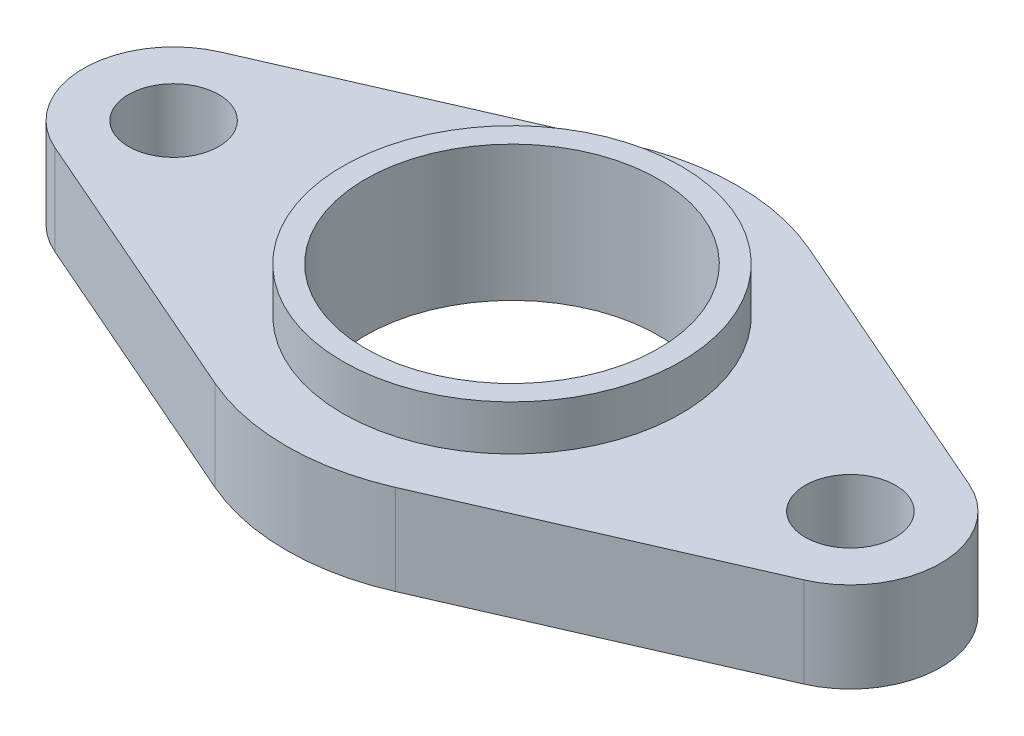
ISO-10303-21;
HEADER;
FILE_DESCRIPTION(('STEP AP214'),'2;1');
FILE_NAME('part.step','',(''),(''),'','','');
FILE_SCHEMA(('AUTOMOTIVE_DESIGN { 1 0 10303 214 1 1 1 1 }'));
ENDSEC;
DATA;
#1=APPLICATION_CONTEXT('core data for automotive mechanical design processes');
#2=APPLICATION_PROTOCOL_DEFINITION('international standard','automotive_design',2000,#1);
#3=PRODUCT_CONTEXT('',#1,'mechanical');
#4=PRODUCT('Part','Part','',(#3));
#5=PRODUCT_RELATED_PRODUCT_CATEGORY('part','',(#4));
#6=PRODUCT_DEFINITION_FORMATION('','',#4);
#7=PRODUCT_DEFINITION_CONTEXT('part definition',#1,'design');
#8=PRODUCT_DEFINITION('design','',#6,#7);
#9=PRODUCT_DEFINITION_SHAPE('','',#8);
#10=(LENGTH_UNIT() NAMED_UNIT(*) SI_UNIT(.MILLI.,.METRE.));
#11=(NAMED_UNIT(*) PLANE_ANGLE_UNIT() SI_UNIT($,.RADIAN.));
#12=(NAMED_UNIT(*) SI_UNIT($,.STERADIAN.) SOLID_ANGLE_UNIT());
#13=UNCERTAINTY_MEASURE_WITH_UNIT(LENGTH_MEASURE(1.E-05),#10,'distance_accuracy_value','');
#14=(GEOMETRIC_REPRESENTATION_CONTEXT(3) GLOBAL_UNCERTAINTY_ASSIGNED_CONTEXT((#13)) GLOBAL_UNIT_ASSIGNED_CONTEXT((#10,
#11,#12)) REPRESENTATION_CONTEXT('',''));
#15=CARTESIAN_POINT('',(0.,0.,0.));
#16=DIRECTION('',(0.,0.,1.));
#17=DIRECTION('',(1.,0.,0.));
#18=AXIS2_PLACEMENT_3D('',#15,#16,#17);
#19=CARTESIAN_POINT('',(-160.531547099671,20.,-15.507238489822));
#20=DIRECTION('',(0.399999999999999,0.,-0.916515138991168));
#21=DIRECTION('',(-0.916515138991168,0.,-0.399999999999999));
#22=AXIS2_PLACEMENT_3D('',#19,#20,#21);
#23=PLANE('',#22);
#24=DIRECTION('',(0.916515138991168,0.,0.399999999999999));
#25=VECTOR('',#24,1.);
#26=CARTESIAN_POINT('',(-160.531547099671,0.,-15.507238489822));
#27=LINE('',#26,#25);
#28=CARTESIAN_POINT('',(-83.,0.,18.3303027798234));
#29=VERTEX_POINT('',#28);
#30=CARTESIAN_POINT('',(-20.,0.,45.8257569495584));
#31=VERTEX_POINT('',#30);
#32=EDGE_CURVE('E98',#29,#31,#27,.T.);
#33=ORIENTED_EDGE('',*,*,#32,.T.);
#34=DIRECTION('',(0.,-1.,0.));
#35=VECTOR('',#34,1.);
#36=CARTESIAN_POINT('',(-20.,20.,45.8257569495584));
#37=LINE('',#36,#35);
#38=CARTESIAN_POINT('',(-20.,20.,45.8257569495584));
#39=VERTEX_POINT('',#38);
#40=EDGE_CURVE('E11',#39,#31,#37,.T.);
#41=ORIENTED_EDGE('',*,*,#40,.F.);
#42=DIRECTION('',(0.916515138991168,0.,0.399999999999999));
#43=VECTOR('',#42,1.);
#44=CARTESIAN_POINT('',(-160.531547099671,20.,-15.507238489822));
#45=LINE('',#44,#43);
#46=CARTESIAN_POINT('',(-83.,20.,18.3303027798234));
#47=VERTEX_POINT('',#46);
#48=EDGE_CURVE('E140',#47,#39,#45,.T.);
#49=ORIENTED_EDGE('',*,*,#48,.F.);
#50=DIRECTION('',(0.,-1.,0.));
#51=VECTOR('',#50,1.);
#52=CARTESIAN_POINT('',(-83.,20.,18.3303027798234));
#53=LINE('',#52,#51);
#54=EDGE_CURVE('E40',#47,#29,#53,.T.);
#55=ORIENTED_EDGE('',*,*,#54,.T.);
#56=EDGE_LOOP('',(#33,#41,#49,#55));
#57=FACE_BOUND('',#56,.T.);
#58=ADVANCED_FACE('F26',(#57),#23,.F.);
#59=CARTESIAN_POINT('',(0.,20.,0.));
#60=DIRECTION('',(0.,-1.,0.));
#61=DIRECTION('',(0.,0.,-1.));
#62=AXIS2_PLACEMENT_3D('',#59,#60,#61);
#63=CYLINDRICAL_SURFACE('',#62,50.);
#64=CARTESIAN_POINT('',(0.,0.,0.));
#65=DIRECTION('',(0.,1.,0.));
#66=DIRECTION('',(0.,0.,1.));
#67=AXIS2_PLACEMENT_3D('',#64,#65,#66);
#68=CIRCLE('',#67,50.);
#69=CARTESIAN_POINT('',(20.,0.,45.8257569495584));
#70=VERTEX_POINT('',#69);
#71=EDGE_CURVE('E93',#31,#70,#68,.T.);
#72=ORIENTED_EDGE('',*,*,#71,.T.);
#73=DIRECTION('',(0.,-1.,0.));
#74=VECTOR('',#73,1.);
#75=CARTESIAN_POINT('',(20.,20.,45.8257569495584));
#76=LINE('',#75,#74);
#77=CARTESIAN_POINT('',(20.,20.,45.8257569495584));
#78=VERTEX_POINT('',#77);
#79=EDGE_CURVE('E33',#78,#70,#76,.T.);
#80=ORIENTED_EDGE('',*,*,#79,.F.);
#81=CARTESIAN_POINT('',(0.,20.,0.));
#82=DIRECTION('',(0.,1.,0.));
#83=DIRECTION('',(0.,0.,1.));
#84=AXIS2_PLACEMENT_3D('',#81,#82,#83);
#85=CIRCLE('',#84,50.);
#86=EDGE_CURVE('E107',#39,#78,#85,.T.);
#87=ORIENTED_EDGE('',*,*,#86,.F.);
#88=ORIENTED_EDGE('',*,*,#40,.T.);
#89=EDGE_LOOP('',(#72,#80,#87,#88));
#90=FACE_BOUND('',#89,.T.);
#91=ADVANCED_FACE('F106',(#90),#63,.T.);
#92=CARTESIAN_POINT('',(-120.918323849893,20.,107.32755560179));
#93=DIRECTION('',(0.399999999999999,0.,0.916515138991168));
#94=DIRECTION('',(0.916515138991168,0.,-0.399999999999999));
#95=AXIS2_PLACEMENT_3D('',#92,#93,#94);
#96=PLANE('',#95);
#97=DIRECTION('',(-0.916515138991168,0.,0.399999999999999));
#98=VECTOR('',#97,1.);
#99=CARTESIAN_POINT('',(-120.918323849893,0.,107.32755560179));
#100=LINE('',#99,#98);
#101=CARTESIAN_POINT('',(83.,0.,18.3303027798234));
#102=VERTEX_POINT('',#101);
#103=EDGE_CURVE('E101',#102,#70,#100,.T.);
#104=ORIENTED_EDGE('',*,*,#103,.F.);
#105=DIRECTION('',(0.,-1.,0.));
#106=VECTOR('',#105,1.);
#107=CARTESIAN_POINT('',(83.,20.,18.3303027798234));
#108=LINE('',#107,#106);
#109=CARTESIAN_POINT('',(83.,20.,18.3303027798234));
#110=VERTEX_POINT('',#109);
#111=EDGE_CURVE('E172',#110,#102,#108,.T.);
#112=ORIENTED_EDGE('',*,*,#111,.F.);
#113=DIRECTION('',(-0.916515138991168,0.,0.399999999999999));
#114=VECTOR('',#113,1.);
#115=CARTESIAN_POINT('',(-120.918323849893,20.,107.32755560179));
#116=LINE('',#115,#114);
#117=EDGE_CURVE('E143',#110,#78,#116,.T.);
#118=ORIENTED_EDGE('',*,*,#117,.T.);
#119=ORIENTED_EDGE('',*,*,#79,.T.);
#120=EDGE_LOOP('',(#104,#112,#118,#119));
#121=FACE_BOUND('',#120,.T.);
#122=ADVANCED_FACE('F174',(#121),#96,.T.);
#123=CARTESIAN_POINT('',(75.,20.,0.));
#124=DIRECTION('',(0.,-1.,0.));
#125=DIRECTION('',(0.,0.,-1.));
#126=AXIS2_PLACEMENT_3D('',#123,#124,#125);
#127=CYLINDRICAL_SURFACE('',#126,20.);
#128=CARTESIAN_POINT('',(75.,0.,0.));
#129=DIRECTION('',(0.,1.,0.));
#130=DIRECTION('',(0.,0.,1.));
#131=AXIS2_PLACEMENT_3D('',#128,#129,#130);
#132=CIRCLE('',#131,20.);
#133=CARTESIAN_POINT('',(83.,0.,-18.3303027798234));
#134=VERTEX_POINT('',#133);
#135=EDGE_CURVE('E118',#102,#134,#132,.T.);
#136=ORIENTED_EDGE('',*,*,#135,.T.);
#137=DIRECTION('',(0.,-1.,0.));
#138=VECTOR('',#137,1.);
#139=CARTESIAN_POINT('',(83.,20.,-18.3303027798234));
#140=LINE('',#139,#138);
#141=CARTESIAN_POINT('',(83.,20.,-18.3303027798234));
#142=VERTEX_POINT('',#141);
#143=EDGE_CURVE('E170',#142,#134,#140,.T.);
#144=ORIENTED_EDGE('',*,*,#143,.F.);
#145=CARTESIAN_POINT('',(75.,20.,0.));
#146=DIRECTION('',(0.,1.,0.));
#147=DIRECTION('',(0.,0.,1.));
#148=AXIS2_PLACEMENT_3D('',#145,#146,#147);
#149=CIRCLE('',#148,20.);
#150=EDGE_CURVE('E146',#110,#142,#149,.T.);
#151=ORIENTED_EDGE('',*,*,#150,.F.);
#152=ORIENTED_EDGE('',*,*,#111,.T.);
#153=EDGE_LOOP('',(#136,#144,#151,#152));
#154=FACE_BOUND('',#153,.T.);
#155=ADVANCED_FACE('F193',(#154),#127,.T.);
#156=CARTESIAN_POINT('',(-120.531547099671,20.,-107.158752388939));
#157=DIRECTION('',(0.4,0.,-0.916515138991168));
#158=DIRECTION('',(-0.916515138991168,0.,-0.4));
#159=AXIS2_PLACEMENT_3D('',#156,#157,#158);
#160=PLANE('',#159);
#161=DIRECTION('',(0.916515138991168,0.,0.4));
#162=VECTOR('',#161,1.);
#163=CARTESIAN_POINT('',(-120.531547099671,0.,-107.158752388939));
#164=LINE('',#163,#162);
#165=CARTESIAN_POINT('',(20.,0.,-45.8257569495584));
#166=VERTEX_POINT('',#165);
#167=EDGE_CURVE('E121',#166,#134,#164,.T.);
#168=ORIENTED_EDGE('',*,*,#167,.F.);
#169=DIRECTION('',(0.,-1.,0.));
#170=VECTOR('',#169,1.);
#171=CARTESIAN_POINT('',(20.,20.,-45.8257569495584));
#172=LINE('',#171,#170);
#173=CARTESIAN_POINT('',(20.,20.,-45.8257569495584));
#174=VERTEX_POINT('',#173);
#175=EDGE_CURVE('E168',#174,#166,#172,.T.);
#176=ORIENTED_EDGE('',*,*,#175,.F.);
#177=DIRECTION('',(0.916515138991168,0.,0.4));
#178=VECTOR('',#177,1.);
#179=CARTESIAN_POINT('',(-120.531547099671,20.,-107.158752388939));
#180=LINE('',#179,#178);
#181=EDGE_CURVE('E148',#174,#142,#180,.T.);
#182=ORIENTED_EDGE('',*,*,#181,.T.);
#183=ORIENTED_EDGE('',*,*,#143,.T.);
#184=EDGE_LOOP('',(#168,#176,#182,#183));
#185=FACE_BOUND('',#184,.T.);
#186=ADVANCED_FACE('F190',(#185),#160,.T.);
#187=CARTESIAN_POINT('',(0.,20.,0.));
#188=DIRECTION('',(0.,-1.,0.));
#189=DIRECTION('',(0.,0.,-1.));
#190=AXIS2_PLACEMENT_3D('',#187,#188,#189);
#191=CYLINDRICAL_SURFACE('',#190,50.);
#192=CARTESIAN_POINT('',(0.,0.,0.));
#193=DIRECTION('',(0.,1.,0.));
#194=DIRECTION('',(0.,0.,1.));
#195=AXIS2_PLACEMENT_3D('',#192,#193,#194);
#196=CIRCLE('',#195,50.);
#197=CARTESIAN_POINT('',(-20.,0.,-45.8257569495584));
#198=VERTEX_POINT('',#197);
#199=EDGE_CURVE('E124',#166,#198,#196,.T.);
#200=ORIENTED_EDGE('',*,*,#199,.T.);
#201=DIRECTION('',(0.,-1.,0.));
#202=VECTOR('',#201,1.);
#203=CARTESIAN_POINT('',(-20.,20.,-45.8257569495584));
#204=LINE('',#203,#202);
#205=CARTESIAN_POINT('',(-20.,20.,-45.8257569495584));
#206=VERTEX_POINT('',#205);
#207=EDGE_CURVE('E165',#206,#198,#204,.T.);
#208=ORIENTED_EDGE('',*,*,#207,.F.);
#209=CARTESIAN_POINT('',(0.,20.,0.));
#210=DIRECTION('',(0.,1.,0.));
#211=DIRECTION('',(0.,0.,1.));
#212=AXIS2_PLACEMENT_3D('',#209,#210,#211);
#213=CIRCLE('',#212,50.);
#214=EDGE_CURVE('E151',#174,#206,#213,.T.);
#215=ORIENTED_EDGE('',*,*,#214,.F.);
#216=ORIENTED_EDGE('',*,*,#175,.T.);
#217=EDGE_LOOP('',(#200,#208,#215,#216));
#218=FACE_BOUND('',#217,.T.);
#219=ADVANCED_FACE('F200',(#218),#191,.T.);
#220=CARTESIAN_POINT('',(-160.918323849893,20.,15.6760417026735));
#221=DIRECTION('',(0.4,0.,0.916515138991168));
#222=DIRECTION('',(0.916515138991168,0.,-0.4));
#223=AXIS2_PLACEMENT_3D('',#220,#221,#222);
#224=PLANE('',#223);
#225=DIRECTION('',(-0.916515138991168,0.,0.4));
#226=VECTOR('',#225,1.);
#227=CARTESIAN_POINT('',(-160.918323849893,0.,15.6760417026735));
#228=LINE('',#227,#226);
#229=CARTESIAN_POINT('',(-83.,0.,-18.3303027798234));
#230=VERTEX_POINT('',#229);
#231=EDGE_CURVE('E126',#198,#230,#228,.T.);
#232=ORIENTED_EDGE('',*,*,#231,.T.);
#233=DIRECTION('',(0.,-1.,0.));
#234=VECTOR('',#233,1.);
#235=CARTESIAN_POINT('',(-83.,20.,-18.3303027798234));
#236=LINE('',#235,#234);
#237=CARTESIAN_POINT('',(-83.,20.,-18.3303027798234));
#238=VERTEX_POINT('',#237);
#239=EDGE_CURVE('E163',#238,#230,#236,.T.);
#240=ORIENTED_EDGE('',*,*,#239,.F.);
#241=DIRECTION('',(-0.916515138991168,0.,0.4));
#242=VECTOR('',#241,1.);
#243=CARTESIAN_POINT('',(-160.918323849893,20.,15.6760417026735));
#244=LINE('',#243,#242);
#245=EDGE_CURVE('E48',#206,#238,#244,.T.);
#246=ORIENTED_EDGE('',*,*,#245,.F.);
#247=ORIENTED_EDGE('',*,*,#207,.T.);
#248=EDGE_LOOP('',(#232,#240,#246,#247));
#249=FACE_BOUND('',#248,.T.);
#250=ADVANCED_FACE('F184',(#249),#224,.F.);
#251=CARTESIAN_POINT('',(75.,20.,0.));
#252=DIRECTION('',(0.,-1.,0.));
#253=DIRECTION('',(0.,0.,-1.));
#254=AXIS2_PLACEMENT_3D('',#251,#252,#253);
#255=CYLINDRICAL_SURFACE('',#254,9.99999999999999);
#256=CARTESIAN_POINT('',(75.,20.,0.));
#257=DIRECTION('',(0.,1.,0.));
#258=DIRECTION('',(0.,0.,1.));
#259=AXIS2_PLACEMENT_3D('',#256,#257,#258);
#260=CIRCLE('',#259,9.99999999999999);
#261=CARTESIAN_POINT('',(75.,20.,9.99999999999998));
#262=VERTEX_POINT('',#261);
#263=EDGE_CURVE('E156',#262,#262,#260,.T.);
#264=ORIENTED_EDGE('',*,*,#263,.T.);
#265=EDGE_LOOP('',(#264));
#266=FACE_BOUND('',#265,.T.);
#267=CARTESIAN_POINT('',(75.,0.,0.));
#268=DIRECTION('',(0.,1.,0.));
#269=DIRECTION('',(0.,0.,1.));
#270=AXIS2_PLACEMENT_3D('',#267,#268,#269);
#271=CIRCLE('',#270,9.99999999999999);
#272=CARTESIAN_POINT('',(75.,0.,9.99999999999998));
#273=VERTEX_POINT('',#272);
#274=EDGE_CURVE('E131',#273,#273,#271,.T.);
#275=ORIENTED_EDGE('',*,*,#274,.F.);
#276=EDGE_LOOP('',(#275));
#277=FACE_BOUND('',#276,.T.);
#278=ADVANCED_FACE('F232',(#266,#277),#255,.F.);
#279=CARTESIAN_POINT('',(-75.,20.,0.));
#280=DIRECTION('',(0.,-1.,0.));
#281=DIRECTION('',(0.,0.,-1.));
#282=AXIS2_PLACEMENT_3D('',#279,#280,#281);
#283=CYLINDRICAL_SURFACE('',#282,20.);
#284=CARTESIAN_POINT('',(-75.,0.,0.));
#285=DIRECTION('',(0.,1.,0.));
#286=DIRECTION('',(0.,0.,1.));
#287=AXIS2_PLACEMENT_3D('',#284,#285,#286);
#288=CIRCLE('',#287,20.);
#289=EDGE_CURVE('E129',#29,#230,#288,.F.);
#290=ORIENTED_EDGE('',*,*,#289,.F.);
#291=ORIENTED_EDGE('',*,*,#54,.F.);
#292=CARTESIAN_POINT('',(-75.,20.,0.));
#293=DIRECTION('',(0.,1.,0.));
#294=DIRECTION('',(0.,0.,1.));
#295=AXIS2_PLACEMENT_3D('',#292,#293,#294);
#296=CIRCLE('',#295,20.);
#297=EDGE_CURVE('E154',#47,#238,#296,.F.);
#298=ORIENTED_EDGE('',*,*,#297,.T.);
#299=ORIENTED_EDGE('',*,*,#239,.T.);
#300=EDGE_LOOP('',(#290,#291,#298,#299));
#301=FACE_BOUND('',#300,.T.);
#302=ADVANCED_FACE('F181',(#301),#283,.T.);
#303=CARTESIAN_POINT('',(-75.,20.,0.));
#304=DIRECTION('',(0.,-1.,0.));
#305=DIRECTION('',(0.,0.,-1.));
#306=AXIS2_PLACEMENT_3D('',#303,#304,#305);
#307=CYLINDRICAL_SURFACE('',#306,9.99999999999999);
#308=CARTESIAN_POINT('',(-75.,20.,0.));
#309=DIRECTION('',(0.,1.,0.));
#310=DIRECTION('',(0.,0.,1.));
#311=AXIS2_PLACEMENT_3D('',#308,#309,#310);
#312=CIRCLE('',#311,9.99999999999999);
#313=CARTESIAN_POINT('',(-75.,20.,9.99999999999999));
#314=VERTEX_POINT('',#313);
#315=EDGE_CURVE('E159',#314,#314,#312,.F.);
#316=ORIENTED_EDGE('',*,*,#315,.F.);
#317=EDGE_LOOP('',(#316));
#318=FACE_BOUND('',#317,.T.);
#319=CARTESIAN_POINT('',(-75.,0.,0.));
#320=DIRECTION('',(0.,1.,0.));
#321=DIRECTION('',(0.,0.,1.));
#322=AXIS2_PLACEMENT_3D('',#319,#320,#321);
#323=CIRCLE('',#322,9.99999999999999);
#324=CARTESIAN_POINT('',(-75.,0.,9.99999999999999));
#325=VERTEX_POINT('',#324);
#326=EDGE_CURVE('E134',#325,#325,#323,.F.);
#327=ORIENTED_EDGE('',*,*,#326,.T.);
#328=EDGE_LOOP('',(#327));
#329=FACE_BOUND('',#328,.T.);
#330=ADVANCED_FACE('F246',(#318,#329),#307,.F.);
#331=CARTESIAN_POINT('',(-167.529685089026,20.,0.527510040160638));
#332=DIRECTION('',(0.,1.,0.));
#333=DIRECTION('',(0.,0.,1.));
#334=AXIS2_PLACEMENT_3D('',#331,#332,#333);
#335=PLANE('',#334);
#336=CARTESIAN_POINT('',(0.,20.,0.));
#337=DIRECTION('',(0.,1.,0.));
#338=DIRECTION('',(0.,0.,1.));
#339=AXIS2_PLACEMENT_3D('',#336,#337,#338);
#340=CIRCLE('',#339,37.5);
#341=CARTESIAN_POINT('',(0.,20.,37.5));
#342=VERTEX_POINT('',#341);
#343=EDGE_CURVE('E137',#342,#342,#340,.T.);
#344=ORIENTED_EDGE('',*,*,#343,.F.);
#345=EDGE_LOOP('',(#344));
#346=FACE_BOUND('',#345,.T.);
#347=ORIENTED_EDGE('',*,*,#48,.T.);
#348=ORIENTED_EDGE('',*,*,#86,.T.);
#349=ORIENTED_EDGE('',*,*,#117,.F.);
#350=ORIENTED_EDGE('',*,*,#150,.T.);
#351=ORIENTED_EDGE('',*,*,#181,.F.);
#352=ORIENTED_EDGE('',*,*,#214,.T.);
#353=ORIENTED_EDGE('',*,*,#245,.T.);
#354=ORIENTED_EDGE('',*,*,#297,.F.);
#355=EDGE_LOOP('',(#347,#348,#349,#350,#351,#352,#353,#354));
#356=FACE_BOUND('',#355,.T.);
#357=ORIENTED_EDGE('',*,*,#263,.F.);
#358=EDGE_LOOP('',(#357));
#359=FACE_BOUND('',#358,.T.);
#360=ORIENTED_EDGE('',*,*,#315,.T.);
#361=EDGE_LOOP('',(#360));
#362=FACE_BOUND('',#361,.T.);
#363=ADVANCED_FACE('F177',(#346,#356,#359,#362),#335,.T.);
#364=CARTESIAN_POINT('',(-167.529685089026,0.,0.527510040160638));
#365=DIRECTION('',(0.,1.,0.));
#366=DIRECTION('',(0.,0.,1.));
#367=AXIS2_PLACEMENT_3D('',#364,#365,#366);
#368=PLANE('',#367);
#369=ORIENTED_EDGE('',*,*,#32,.F.);
#370=ORIENTED_EDGE('',*,*,#289,.T.);
#371=ORIENTED_EDGE('',*,*,#231,.F.);
#372=ORIENTED_EDGE('',*,*,#199,.F.);
#373=ORIENTED_EDGE('',*,*,#167,.T.);
#374=ORIENTED_EDGE('',*,*,#135,.F.);
#375=ORIENTED_EDGE('',*,*,#103,.T.);
#376=ORIENTED_EDGE('',*,*,#71,.F.);
#377=EDGE_LOOP('',(#369,#370,#371,#372,#373,#374,#375,#376));
#378=FACE_BOUND('',#377,.T.);
#379=ORIENTED_EDGE('',*,*,#274,.T.);
#380=EDGE_LOOP('',(#379));
#381=FACE_BOUND('',#380,.T.);
#382=ORIENTED_EDGE('',*,*,#326,.F.);
#383=EDGE_LOOP('',(#382));
#384=FACE_BOUND('',#383,.T.);
#385=CARTESIAN_POINT('',(0.,0.,0.));
#386=DIRECTION('',(0.,1.,0.));
#387=DIRECTION('',(0.,0.,1.));
#388=AXIS2_PLACEMENT_3D('',#385,#386,#387);
#389=CIRCLE('',#388,32.5);
#390=CARTESIAN_POINT('',(0.,0.,32.5));
#391=VERTEX_POINT('',#390);
#392=EDGE_CURVE('E300',#391,#391,#389,.T.);
#393=ORIENTED_EDGE('',*,*,#392,.T.);
#394=EDGE_LOOP('',(#393));
#395=FACE_BOUND('',#394,.T.);
#396=ADVANCED_FACE('F94',(#378,#381,#384,#395),#368,.F.);
#397=CARTESIAN_POINT('',(0.,30.,0.));
#398=DIRECTION('',(0.,-1.,0.));
#399=DIRECTION('',(0.,0.,-1.));
#400=AXIS2_PLACEMENT_3D('',#397,#398,#399);
#401=CYLINDRICAL_SURFACE('',#400,32.5);
#402=CARTESIAN_POINT('',(0.,30.,0.));
#403=DIRECTION('',(0.,1.,0.));
#404=DIRECTION('',(0.,0.,1.));
#405=AXIS2_PLACEMENT_3D('',#402,#403,#404);
#406=CIRCLE('',#405,32.5);
#407=CARTESIAN_POINT('',(0.,30.,32.5));
#408=VERTEX_POINT('',#407);
#409=EDGE_CURVE('E113',#408,#408,#406,.T.);
#410=ORIENTED_EDGE('',*,*,#409,.T.);
#411=EDGE_LOOP('',(#410));
#412=FACE_BOUND('',#411,.T.);
#413=ORIENTED_EDGE('',*,*,#392,.F.);
#414=EDGE_LOOP('',(#413));
#415=FACE_BOUND('',#414,.T.);
#416=ADVANCED_FACE('F267',(#412,#415),#401,.F.);
#417=CARTESIAN_POINT('',(0.,30.,0.));
#418=DIRECTION('',(0.,-1.,0.));
#419=DIRECTION('',(0.,0.,-1.));
#420=AXIS2_PLACEMENT_3D('',#417,#418,#419);
#421=CYLINDRICAL_SURFACE('',#420,37.5);
#422=ORIENTED_EDGE('',*,*,#343,.T.);
#423=EDGE_LOOP('',(#422));
#424=FACE_BOUND('',#423,.T.);
#425=CARTESIAN_POINT('',(0.,30.,0.));
#426=DIRECTION('',(0.,1.,0.));
#427=DIRECTION('',(0.,0.,1.));
#428=AXIS2_PLACEMENT_3D('',#425,#426,#427);
#429=CIRCLE('',#428,37.5);
#430=CARTESIAN_POINT('',(0.,30.,37.5));
#431=VERTEX_POINT('',#430);
#432=EDGE_CURVE('E110',#431,#431,#429,.T.);
#433=ORIENTED_EDGE('',*,*,#432,.F.);
#434=EDGE_LOOP('',(#433));
#435=FACE_BOUND('',#434,.T.);
#436=ADVANCED_FACE('F277',(#424,#435),#421,.T.);
#437=CARTESIAN_POINT('',(-167.529685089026,30.,0.527510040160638));
#438=DIRECTION('',(0.,1.,0.));
#439=DIRECTION('',(0.,0.,1.));
#440=AXIS2_PLACEMENT_3D('',#437,#438,#439);
#441=PLANE('',#440);
#442=ORIENTED_EDGE('',*,*,#409,.F.);
#443=EDGE_LOOP('',(#442));
#444=FACE_BOUND('',#443,.T.);
#445=ORIENTED_EDGE('',*,*,#432,.T.);
#446=EDGE_LOOP('',(#445));
#447=FACE_BOUND('',#446,.T.);
#448=ADVANCED_FACE('F285',(#444,#447),#441,.T.);
#449=CLOSED_SHELL('',(#58,#91,#122,#155,#186,#219,#250,#278,#302,#330,#363,#396,#416,#436,#448));
#450=MANIFOLD_SOLID_BREP('B2',#449);
#451=ADVANCED_BREP_SHAPE_REPRESENTATION('',(#18,#450),#14);
#452=SHAPE_DEFINITION_REPRESENTATION(#9,#451);
ENDSEC;
END-ISO-10303-21;
